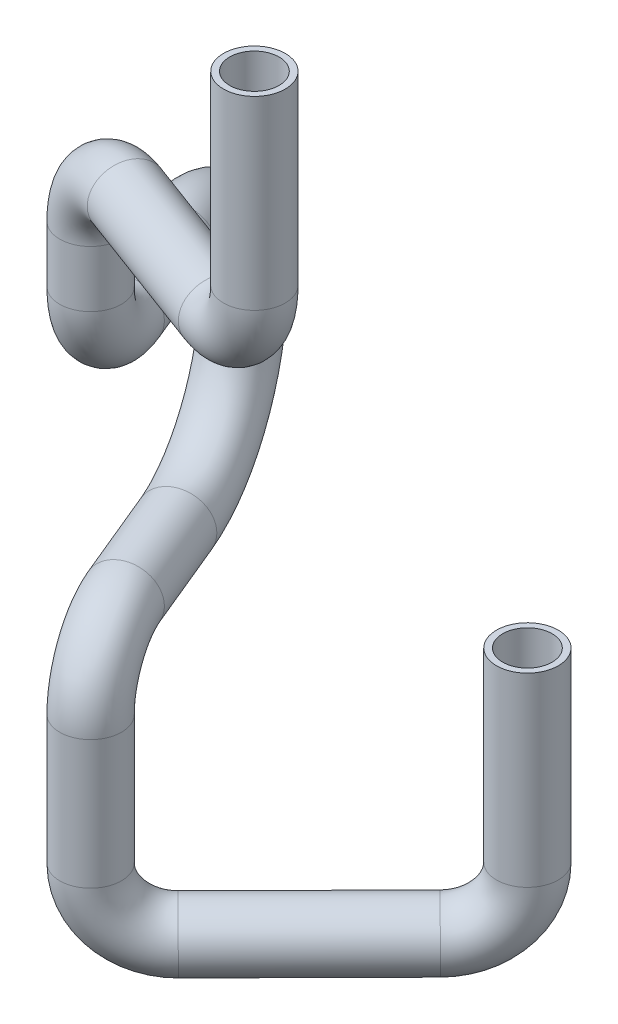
from build123d import *

# Parameters (mm, degrees)
ESQUISSE1_R   = 5
ESQUISSE1_R_2 = 4


with BuildPart() as part:
    # Balayage3: sweep along a curve in space
    with BuildLine() as balayage3_path:
        Line((0, 0, 57.917659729), (0, -30, 57.917659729))
        ThreePointArc((0, -30, 57.917659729), (-2.745170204, -37.071067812, 56.89654058), (-9.37259734, -40, 54.431340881))
        Line((-9.37259734, -40, 54.431340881), (-32.842383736, -40, 45.701299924))
        ThreePointArc((-32.842383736, -40, 45.701299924), (-39.469810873, -42.928932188, 43.236100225), (-42.214981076, -50, 42.214981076))
        Line((-42.214981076, -50, 42.214981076), (-42.214981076, -59.135160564, 42.214981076))
        ThreePointArc((-46.0418154, -69.135160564, 32.976185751), (-43.335834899, -66.206228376, 39.509000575), (-42.214981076, -59.135160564, 42.214981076))
        Line((-46.0418154, -69.135160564, 32.976185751), (-52.047330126, -69.135160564, 18.47759065))
        ThreePointArc((-52.047330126, -69.135160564, 18.47759065), (-59.700998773, -89.135160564, 0), (-52.047330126, -109.135160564, 18.47759065))
        Line((-52.047330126, -109.135160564, 18.47759065), (-46.0418154, -109.135160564, 32.976185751))
        ThreePointArc((-46.0418154, -109.135160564, 32.976185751), (-43.335834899, -112.064092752, 39.509000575), (-42.214981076, -119.135160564, 42.214981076))
        Line((-42.214981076, -119.135160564, 42.214981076), (-42.214981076, -139.962263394, 42.214981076))
        ThreePointArc((-35.117279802, -149.96219246, 35.117279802), (-40.13448803, -147.046635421, 40.13448803), (-42.214981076, -139.962263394, 42.214981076))
        Line((-35.117279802, -149.96219246, 35.117279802), (-13.904327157, -149.849196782, 13.904327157))
        ThreePointArc((-13.904327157, -149.849196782, 13.904327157), (-8.921553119, -146.907006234, 8.921553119), (-6.859892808, -139.849267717, 6.859892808))
        Line((-6.859892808, -139.849267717, 6.859892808), (-6.859892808, -109.811672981, 6.859892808))
    # Esquisse1 → Balayage3 (sweep)
    with BuildSketch(Plane(origin=(0, 0, 0), x_dir=(1, 0, 0), z_dir=(0, 1, 0))):
        with Locations((0, -57.917659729)):
            Circle(ESQUISSE1_R)
        with Locations((0, -57.917659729)):
            Circle(ESQUISSE1_R_2, mode=Mode.SUBTRACT)
    sweep(path=balayage3_path.line)


solid = part.part
